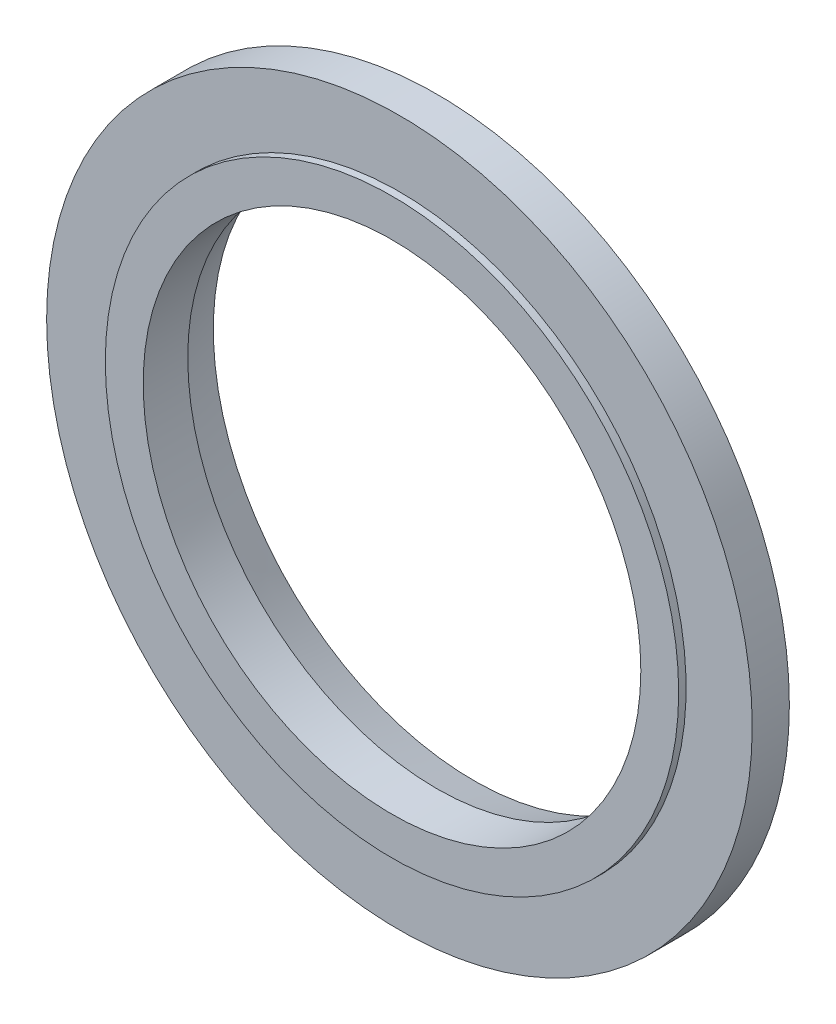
ISO-10303-21;
HEADER;
FILE_DESCRIPTION(('STEP AP214'),'2;1');
FILE_NAME('part.step','',(''),(''),'','','');
FILE_SCHEMA(('AUTOMOTIVE_DESIGN { 1 0 10303 214 1 1 1 1 }'));
ENDSEC;
DATA;
#1=APPLICATION_CONTEXT('core data for automotive mechanical design processes');
#2=APPLICATION_PROTOCOL_DEFINITION('international standard','automotive_design',2000,#1);
#3=PRODUCT_CONTEXT('',#1,'mechanical');
#4=PRODUCT('Part','Part','',(#3));
#5=PRODUCT_RELATED_PRODUCT_CATEGORY('part','',(#4));
#6=PRODUCT_DEFINITION_FORMATION('','',#4);
#7=PRODUCT_DEFINITION_CONTEXT('part definition',#1,'design');
#8=PRODUCT_DEFINITION('design','',#6,#7);
#9=PRODUCT_DEFINITION_SHAPE('','',#8);
#10=(LENGTH_UNIT() NAMED_UNIT(*) SI_UNIT(.MILLI.,.METRE.));
#11=(NAMED_UNIT(*) PLANE_ANGLE_UNIT() SI_UNIT($,.RADIAN.));
#12=(NAMED_UNIT(*) SI_UNIT($,.STERADIAN.) SOLID_ANGLE_UNIT());
#13=UNCERTAINTY_MEASURE_WITH_UNIT(LENGTH_MEASURE(1.E-05),#10,'distance_accuracy_value','');
#14=(GEOMETRIC_REPRESENTATION_CONTEXT(3) GLOBAL_UNCERTAINTY_ASSIGNED_CONTEXT((#13)) GLOBAL_UNIT_ASSIGNED_CONTEXT((#10,
#11,#12)) REPRESENTATION_CONTEXT('',''));
#15=CARTESIAN_POINT('',(0.,0.,0.));
#16=DIRECTION('',(0.,0.,1.));
#17=DIRECTION('',(1.,0.,0.));
#18=AXIS2_PLACEMENT_3D('',#15,#16,#17);
#19=CARTESIAN_POINT('',(0.,0.,3.175));
#20=DIRECTION('',(0.,0.,-1.));
#21=DIRECTION('',(-1.,0.,0.));
#22=AXIS2_PLACEMENT_3D('',#19,#20,#21);
#23=CYLINDRICAL_SURFACE('',#22,24.511);
#24=CARTESIAN_POINT('',(0.,0.,3.175));
#25=DIRECTION('',(0.,0.,1.));
#26=DIRECTION('',(1.,0.,0.));
#27=AXIS2_PLACEMENT_3D('',#24,#25,#26);
#28=CIRCLE('',#27,24.511);
#29=CARTESIAN_POINT('',(24.511,0.,3.175));
#30=VERTEX_POINT('',#29);
#31=EDGE_CURVE('E36',#30,#30,#28,.T.);
#32=ORIENTED_EDGE('',*,*,#31,.F.);
#33=EDGE_LOOP('',(#32));
#34=FACE_BOUND('',#33,.T.);
#35=CARTESIAN_POINT('',(0.,0.,2.54));
#36=DIRECTION('',(0.,0.,-1.));
#37=DIRECTION('',(-1.,0.,0.));
#38=AXIS2_PLACEMENT_3D('',#35,#36,#37);
#39=CIRCLE('',#38,24.511);
#40=CARTESIAN_POINT('',(-24.511,0.,2.54));
#41=VERTEX_POINT('',#40);
#42=EDGE_CURVE('E10',#41,#41,#39,.T.);
#43=ORIENTED_EDGE('',*,*,#42,.F.);
#44=EDGE_LOOP('',(#43));
#45=FACE_BOUND('',#44,.T.);
#46=ADVANCED_FACE('F28',(#34,#45),#23,.T.);
#47=CARTESIAN_POINT('',(0.,0.,3.175));
#48=DIRECTION('',(0.,0.,1.));
#49=DIRECTION('',(1.,0.,0.));
#50=AXIS2_PLACEMENT_3D('',#47,#48,#49);
#51=PLANE('',#50);
#52=CARTESIAN_POINT('',(0.,0.,3.175));
#53=DIRECTION('',(0.,0.,1.));
#54=DIRECTION('',(1.,0.,0.));
#55=AXIS2_PLACEMENT_3D('',#52,#53,#54);
#56=CIRCLE('',#55,21.2725);
#57=CARTESIAN_POINT('',(21.2725,0.,3.175));
#58=VERTEX_POINT('',#57);
#59=EDGE_CURVE('E66',#58,#58,#56,.T.);
#60=ORIENTED_EDGE('',*,*,#59,.F.);
#61=EDGE_LOOP('',(#60));
#62=FACE_BOUND('',#61,.T.);
#63=ORIENTED_EDGE('',*,*,#31,.T.);
#64=EDGE_LOOP('',(#63));
#65=FACE_BOUND('',#64,.T.);
#66=ADVANCED_FACE('F108',(#62,#65),#51,.T.);
#67=CARTESIAN_POINT('',(0.,0.,2.54));
#68=DIRECTION('',(0.,0.,-1.));
#69=DIRECTION('',(-1.,0.,0.));
#70=AXIS2_PLACEMENT_3D('',#67,#68,#69);
#71=PLANE('',#70);
#72=ORIENTED_EDGE('',*,*,#42,.T.);
#73=EDGE_LOOP('',(#72));
#74=FACE_BOUND('',#73,.T.);
#75=CARTESIAN_POINT('',(0.,0.,2.54));
#76=DIRECTION('',(0.,0.,1.));
#77=DIRECTION('',(1.,0.,0.));
#78=AXIS2_PLACEMENT_3D('',#75,#76,#77);
#79=CIRCLE('',#78,30.1625);
#80=CARTESIAN_POINT('',(30.1625,0.,2.54));
#81=VERTEX_POINT('',#80);
#82=EDGE_CURVE('E70',#81,#81,#79,.T.);
#83=ORIENTED_EDGE('',*,*,#82,.T.);
#84=EDGE_LOOP('',(#83));
#85=FACE_BOUND('',#84,.T.);
#86=ADVANCED_FACE('F90',(#74,#85),#71,.F.);
#87=CARTESIAN_POINT('',(0.,0.,-0.635));
#88=DIRECTION('',(0.,0.,-1.));
#89=DIRECTION('',(-1.,0.,0.));
#90=AXIS2_PLACEMENT_3D('',#87,#88,#89);
#91=PLANE('',#90);
#92=CARTESIAN_POINT('',(0.,0.,-0.635));
#93=DIRECTION('',(0.,0.,-1.));
#94=DIRECTION('',(-1.,0.,0.));
#95=AXIS2_PLACEMENT_3D('',#92,#93,#94);
#96=CIRCLE('',#95,24.511);
#97=CARTESIAN_POINT('',(-24.511,0.,-0.635));
#98=VERTEX_POINT('',#97);
#99=EDGE_CURVE('E45',#98,#98,#96,.T.);
#100=ORIENTED_EDGE('',*,*,#99,.F.);
#101=EDGE_LOOP('',(#100));
#102=FACE_BOUND('',#101,.T.);
#103=CARTESIAN_POINT('',(0.,0.,-0.634999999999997));
#104=DIRECTION('',(0.,0.,-1.));
#105=DIRECTION('',(-1.,0.,0.));
#106=AXIS2_PLACEMENT_3D('',#103,#104,#105);
#107=CIRCLE('',#106,30.1625);
#108=CARTESIAN_POINT('',(-30.1625,0.,-0.634999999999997));
#109=VERTEX_POINT('',#108);
#110=EDGE_CURVE('E75',#109,#109,#107,.F.);
#111=ORIENTED_EDGE('',*,*,#110,.F.);
#112=EDGE_LOOP('',(#111));
#113=FACE_BOUND('',#112,.T.);
#114=ADVANCED_FACE('F86',(#102,#113),#91,.T.);
#115=CARTESIAN_POINT('',(0.,0.,-0.635));
#116=DIRECTION('',(0.,0.,-1.));
#117=DIRECTION('',(-1.,0.,0.));
#118=AXIS2_PLACEMENT_3D('',#115,#116,#117);
#119=CIRCLE('',#118,21.2725);
#120=CARTESIAN_POINT('',(-21.2725,0.,-0.635));
#121=VERTEX_POINT('',#120);
#122=EDGE_CURVE('E32',#121,#121,#119,.T.);
#123=ORIENTED_EDGE('',*,*,#122,.F.);
#124=EDGE_LOOP('',(#123));
#125=FACE_BOUND('',#124,.T.);
#126=CARTESIAN_POINT('',(0.,0.,-0.635));
#127=DIRECTION('',(0.,0.,-1.));
#128=DIRECTION('',(-1.,0.,0.));
#129=AXIS2_PLACEMENT_3D('',#126,#127,#128);
#130=CIRCLE('',#129,21.336);
#131=CARTESIAN_POINT('',(-21.336,0.,-0.635));
#132=VERTEX_POINT('',#131);
#133=EDGE_CURVE('E63',#132,#132,#130,.F.);
#134=ORIENTED_EDGE('',*,*,#133,.F.);
#135=EDGE_LOOP('',(#134));
#136=FACE_BOUND('',#135,.T.);
#137=ADVANCED_FACE('F89',(#125,#136),#91,.T.);
#138=ORIENTED_EDGE('',*,*,#99,.T.);
#139=EDGE_LOOP('',(#138));
#140=FACE_BOUND('',#139,.T.);
#141=CARTESIAN_POINT('',(0.,0.,-0.6604));
#142=DIRECTION('',(0.,0.,1.));
#143=DIRECTION('',(1.,0.,0.));
#144=AXIS2_PLACEMENT_3D('',#141,#142,#143);
#145=CIRCLE('',#144,24.511);
#146=CARTESIAN_POINT('',(24.511,0.,-0.6604));
#147=VERTEX_POINT('',#146);
#148=EDGE_CURVE('E47',#147,#147,#145,.T.);
#149=ORIENTED_EDGE('',*,*,#148,.T.);
#150=EDGE_LOOP('',(#149));
#151=FACE_BOUND('',#150,.T.);
#152=ADVANCED_FACE('F30',(#140,#151),#23,.T.);
#153=CARTESIAN_POINT('',(0.,0.,-3.8354));
#154=DIRECTION('',(0.,0.,1.));
#155=DIRECTION('',(1.,0.,0.));
#156=AXIS2_PLACEMENT_3D('',#153,#154,#155);
#157=CONICAL_SURFACE('',#156,23.5585,0.291456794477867);
#158=ORIENTED_EDGE('',*,*,#148,.F.);
#159=EDGE_LOOP('',(#158));
#160=FACE_BOUND('',#159,.T.);
#161=CARTESIAN_POINT('',(0.,0.,-3.8354));
#162=DIRECTION('',(0.,0.,1.));
#163=DIRECTION('',(1.,0.,0.));
#164=AXIS2_PLACEMENT_3D('',#161,#162,#163);
#165=CIRCLE('',#164,23.5585);
#166=CARTESIAN_POINT('',(23.5585,0.,-3.8354));
#167=VERTEX_POINT('',#166);
#168=EDGE_CURVE('E50',#167,#167,#165,.T.);
#169=ORIENTED_EDGE('',*,*,#168,.T.);
#170=EDGE_LOOP('',(#169));
#171=FACE_BOUND('',#170,.T.);
#172=ADVANCED_FACE('F117',(#160,#171),#157,.T.);
#173=CARTESIAN_POINT('',(0.,0.,3.175));
#174=DIRECTION('',(0.,0.,1.));
#175=DIRECTION('',(1.,0.,0.));
#176=AXIS2_PLACEMENT_3D('',#173,#174,#175);
#177=CYLINDRICAL_SURFACE('',#176,23.5585);
#178=CARTESIAN_POINT('',(0.,0.,-0.635));
#179=DIRECTION('',(0.,0.,-1.));
#180=DIRECTION('',(-1.,0.,0.));
#181=AXIS2_PLACEMENT_3D('',#178,#179,#180);
#182=CIRCLE('',#181,23.5585);
#183=CARTESIAN_POINT('',(-23.5585,0.,-0.635));
#184=VERTEX_POINT('',#183);
#185=EDGE_CURVE('E57',#184,#184,#182,.F.);
#186=ORIENTED_EDGE('',*,*,#185,.T.);
#187=EDGE_LOOP('',(#186));
#188=FACE_BOUND('',#187,.T.);
#189=ORIENTED_EDGE('',*,*,#168,.F.);
#190=EDGE_LOOP('',(#189));
#191=FACE_BOUND('',#190,.T.);
#192=ADVANCED_FACE('F122',(#188,#191),#177,.F.);
#193=ORIENTED_EDGE('',*,*,#185,.F.);
#194=EDGE_LOOP('',(#193));
#195=FACE_BOUND('',#194,.T.);
#196=CARTESIAN_POINT('',(0.,0.,-0.635));
#197=DIRECTION('',(0.,0.,-1.));
#198=DIRECTION('',(-1.,0.,0.));
#199=AXIS2_PLACEMENT_3D('',#196,#197,#198);
#200=CIRCLE('',#199,22.2885);
#201=CARTESIAN_POINT('',(-22.2885,0.,-0.635));
#202=VERTEX_POINT('',#201);
#203=EDGE_CURVE('E59',#202,#202,#200,.T.);
#204=ORIENTED_EDGE('',*,*,#203,.F.);
#205=EDGE_LOOP('',(#204));
#206=FACE_BOUND('',#205,.T.);
#207=ADVANCED_FACE('F92',(#195,#206),#91,.T.);
#208=CARTESIAN_POINT('',(0.,0.,3.175));
#209=DIRECTION('',(0.,0.,1.));
#210=DIRECTION('',(1.,0.,0.));
#211=AXIS2_PLACEMENT_3D('',#208,#209,#210);
#212=CYLINDRICAL_SURFACE('',#211,21.336);
#213=ORIENTED_EDGE('',*,*,#133,.T.);
#214=EDGE_LOOP('',(#213));
#215=FACE_BOUND('',#214,.T.);
#216=CARTESIAN_POINT('',(0.,0.,-0.6604));
#217=DIRECTION('',(0.,0.,1.));
#218=DIRECTION('',(1.,0.,0.));
#219=AXIS2_PLACEMENT_3D('',#216,#217,#218);
#220=CIRCLE('',#219,21.336);
#221=CARTESIAN_POINT('',(21.336,0.,-0.6604));
#222=VERTEX_POINT('',#221);
#223=EDGE_CURVE('E41',#222,#222,#220,.T.);
#224=ORIENTED_EDGE('',*,*,#223,.F.);
#225=EDGE_LOOP('',(#224));
#226=FACE_BOUND('',#225,.T.);
#227=ADVANCED_FACE('F131',(#215,#226),#212,.F.);
#228=CARTESIAN_POINT('',(0.,0.,-0.6604));
#229=DIRECTION('',(0.,0.,-1.));
#230=DIRECTION('',(-1.,0.,0.));
#231=AXIS2_PLACEMENT_3D('',#228,#229,#230);
#232=CONICAL_SURFACE('',#231,21.336,0.291456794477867);
#233=CARTESIAN_POINT('',(0.,0.,-3.8354));
#234=DIRECTION('',(0.,0.,1.));
#235=DIRECTION('',(1.,0.,0.));
#236=AXIS2_PLACEMENT_3D('',#233,#234,#235);
#237=CIRCLE('',#236,22.2885);
#238=CARTESIAN_POINT('',(22.2885,0.,-3.8354));
#239=VERTEX_POINT('',#238);
#240=EDGE_CURVE('E53',#239,#239,#237,.T.);
#241=ORIENTED_EDGE('',*,*,#240,.F.);
#242=EDGE_LOOP('',(#241));
#243=FACE_BOUND('',#242,.T.);
#244=ORIENTED_EDGE('',*,*,#223,.T.);
#245=EDGE_LOOP('',(#244));
#246=FACE_BOUND('',#245,.T.);
#247=ADVANCED_FACE('F137',(#243,#246),#232,.F.);
#248=CARTESIAN_POINT('',(0.,0.,3.175));
#249=DIRECTION('',(0.,0.,1.));
#250=DIRECTION('',(1.,0.,0.));
#251=AXIS2_PLACEMENT_3D('',#248,#249,#250);
#252=CYLINDRICAL_SURFACE('',#251,22.2885);
#253=ORIENTED_EDGE('',*,*,#203,.T.);
#254=EDGE_LOOP('',(#253));
#255=FACE_BOUND('',#254,.T.);
#256=ORIENTED_EDGE('',*,*,#240,.T.);
#257=EDGE_LOOP('',(#256));
#258=FACE_BOUND('',#257,.T.);
#259=ADVANCED_FACE('F104',(#255,#258),#252,.T.);
#260=CARTESIAN_POINT('',(0.,0.,-3.8354));
#261=DIRECTION('',(0.,0.,1.));
#262=DIRECTION('',(1.,0.,0.));
#263=AXIS2_PLACEMENT_3D('',#260,#261,#262);
#264=CYLINDRICAL_SURFACE('',#263,21.2725);
#265=ORIENTED_EDGE('',*,*,#122,.T.);
#266=EDGE_LOOP('',(#265));
#267=FACE_BOUND('',#266,.T.);
#268=ORIENTED_EDGE('',*,*,#59,.T.);
#269=EDGE_LOOP('',(#268));
#270=FACE_BOUND('',#269,.T.);
#271=ADVANCED_FACE('F98',(#267,#270),#264,.F.);
#272=CARTESIAN_POINT('',(0.,0.,-85.947433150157));
#273=DIRECTION('',(0.,0.,1.));
#274=DIRECTION('',(1.,0.,0.));
#275=AXIS2_PLACEMENT_3D('',#272,#273,#274);
#276=CYLINDRICAL_SURFACE('',#275,30.1625);
#277=ORIENTED_EDGE('',*,*,#82,.F.);
#278=EDGE_LOOP('',(#277));
#279=FACE_BOUND('',#278,.T.);
#280=ORIENTED_EDGE('',*,*,#110,.T.);
#281=EDGE_LOOP('',(#280));
#282=FACE_BOUND('',#281,.T.);
#283=ADVANCED_FACE('F96',(#279,#282),#276,.T.);
#284=CLOSED_SHELL('',(#46,#66,#86,#114,#137,#152,#172,#192,#207,#227,#247,#259,#271,#283));
#285=MANIFOLD_SOLID_BREP('B2',#284);
#286=ADVANCED_BREP_SHAPE_REPRESENTATION('',(#18,#285),#14);
#287=SHAPE_DEFINITION_REPRESENTATION(#9,#286);
ENDSEC;
END-ISO-10303-21;
